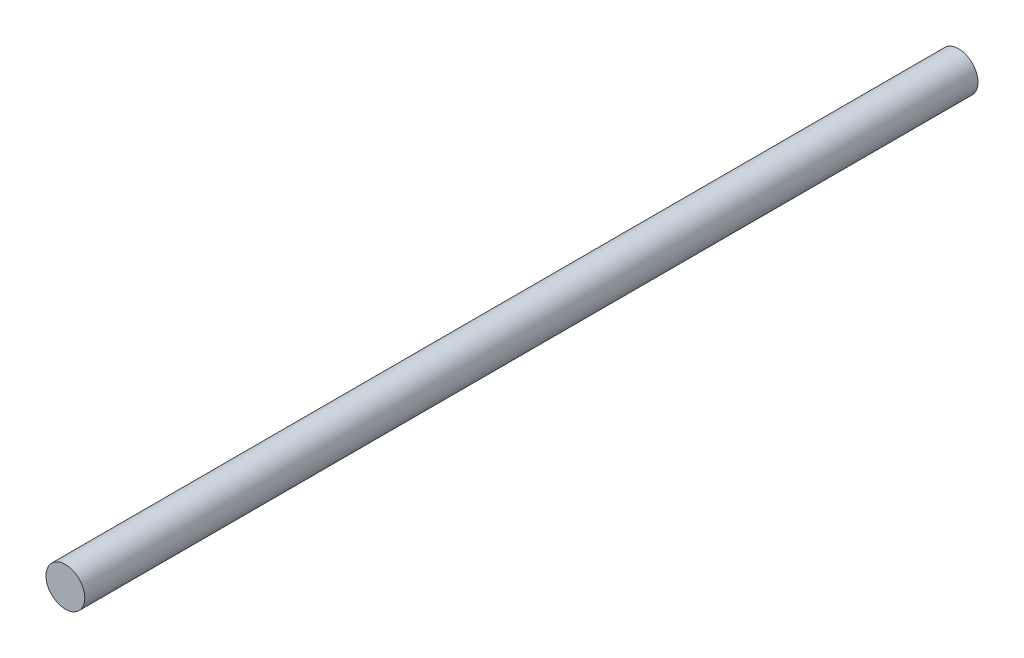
from build123d import *

# Parameters (mm, degrees)
SKETCH1_R      = 6.35
EXTRUDE1_DEPTH = 292.1


with BuildPart() as part:
    # Sketch1 → Extrude1 (new body)
    with BuildSketch(Plane.XY):
        Circle(SKETCH1_R)
    extrude(amount=EXTRUDE1_DEPTH)


solid = part.part
